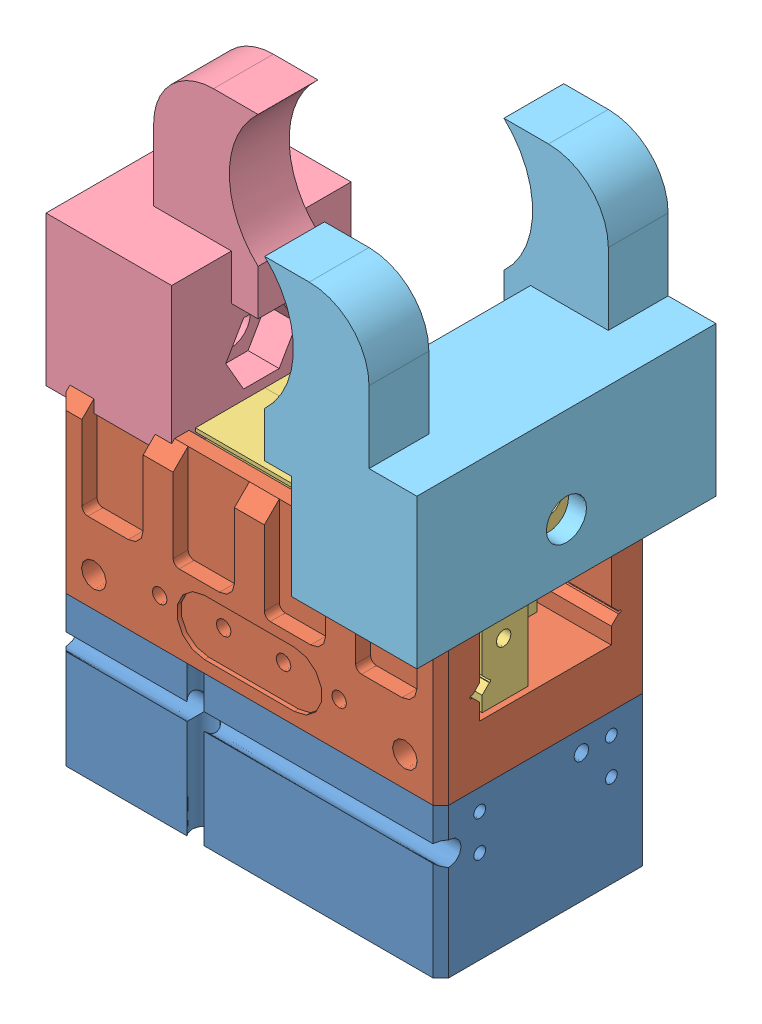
SolidWorks assembly scissor_draft0_assembly.SLDASM, configuration Default (file format 15000). Lengths in mm.
Overall size (72 98.4 50).
6 component instances, 5 part files, 15 mates.
Components (placement in the parent):
- SCHUNK-5518814 Gehaeuse MPG-plus 64-1: SCHUNK-5518814 Gehaeuse MPG-plus 64.sldprt [Default] at (0 25 0) x (1 0 0) z (0 0 -1) size (64.01 25 35.01)
- SCHUNK-5518813 Abdeckgehaeuse MPG-plus 64-1: SCHUNK-5518813 Abdeckgehaeuse MPG-plus 64.sldprt [Default] at (0 25 0) x (0 0 1) z (-1 0 0) size (35 29 64)
- SCHUNK-5518813 Finger MPG-plus 64-1: SCHUNK-5518813 Finger MPG-plus 64.sldprt [Default] at (-32 69.7 -0.75) x (-1 0 0) z (0 0 1) size (54 35.1 21.5)
- SCHUNK-5518813 Finger MPG-plus 64-2: SCHUNK-5518813 Finger MPG-plus 64.sldprt [Default] at (32 69.7 0.75) x (1 0 0) z (0 0 -1) size (54 35.1 21.5)
- gripper_1prong_draft2-1: gripper_1prong_draft2.SLDPRT [Default] at (-3 39.2255 0.5) x (1 0 0) z (0 0 -1) size (25.45 47 30)
- gripper_2prong_draft2-1: gripper_2prong_draft2.SLDPRT [Default] at (3 39.2255 0.5) x (-1 0 0) z (0 0 1) size (25.45 47 50)
Mates (geometry in assembly coordinates):
- Coincident2: coincident anti-aligned: plane of SCHUNK-5518814 Gehaeuse MPG-plus 64-1 through (-32 25 17.5) normal (0 1 0); plane of SCHUNK-5518813 Abdeckgehaeuse MPG-plus 64-1 through (32 25 -17.5) normal (0 -1 0)
- Coincident3: coincident aligned: plane of SCHUNK-5518814 Gehaeuse MPG-plus 64-1 through (-32 25 -16.2) normal (-1 0 0); plane of SCHUNK-5518813 Abdeckgehaeuse MPG-plus 64-1 through (-32 25 16.2) normal (-1 0 0)
- Coincident4: coincident aligned: plane of SCHUNK-5518814 Gehaeuse MPG-plus 64-1 through (30.7 25 -17.5) normal (0 0 -1); plane of SCHUNK-5518813 Abdeckgehaeuse MPG-plus 64-1 through (-30.7 25 -17.5) normal (0 0 -1)
- Distance4: distance = 1.4 mm anti-aligned: plane of SCHUNK-5518813 Abdeckgehaeuse MPG-plus 64-1 through (-32 40.17 -11) normal (0 0 1); plane of SCHUNK-5518813 Finger MPG-plus 64-1 through (21 47.13 -9.6) normal (0 0 -1)
- Distance5: distance = 3.9 mm anti-aligned: plane of SCHUNK-5518813 Finger MPG-plus 64-1 through (-31 51.4 -1.95) normal (0 0 1); plane of SCHUNK-5518813 Finger MPG-plus 64-2 through (31 51.4 1.95) normal (0 0 -1)
- Coincident10: coincident anti-aligned: plane of SCHUNK-5518813 Abdeckgehaeuse MPG-plus 64-1 through (32 34.6 -11) normal (0 1 0); plane of SCHUNK-5518813 Finger MPG-plus 64-1 through (21 34.6 -1.95) normal (0 -1 0)
- LimitDistance2: limit distance aligned: plane of SCHUNK-5518813 Finger MPG-plus 64-1 through (-32 69.7 -11.5) normal (-1 0 0); plane of SCHUNK-5518813 Abdeckgehaeuse MPG-plus 64-1 through (-32 25 16.2) normal (-1 0 0)
- LimitDistance3: limit distance aligned: plane of SCHUNK-5518813 Finger MPG-plus 64-2 through (32 69.7 11.5) normal (1 0 0); plane of SCHUNK-5518813 Abdeckgehaeuse MPG-plus 64-1 through (32 25 16.2) normal (1 0 0)
- Coincident15: coincident anti-aligned: plane of SCHUNK-5518813 Abdeckgehaeuse MPG-plus 64-1 through (32 34.6 -11) normal (0 1 0); plane of SCHUNK-5518813 Finger MPG-plus 64-2 through (-21 34.6 1.95) normal (0 -1 0)
- Coincident16: coincident anti-aligned: plane of SCHUNK-5518813 Finger MPG-plus 64-1 through (-22 69.7 -10) normal (0 1 0); plane of gripper_1prong_draft2-1 through (-3 69.7 0.5) normal (0 -1 0)
- Coincident17: coincident anti-aligned: plane of SCHUNK-5518813 Finger MPG-plus 64-1 through (-22 69.7 -10) normal (0 0 -1); plane of gripper_1prong_draft2-1 through (-33 69.7 -10) normal (0 0 1)
- Coincident18: coincident anti-aligned: plane of SCHUNK-5518813 Finger MPG-plus 64-1 through (-22 69.7 10) normal (1 0 0); plane of gripper_1prong_draft2-1 through (-22 69.7 11) normal (-1 0 0)
- Coincident19: coincident anti-aligned: plane of SCHUNK-5518813 Finger MPG-plus 64-2 through (22 69.7 10) normal (0 1 0); plane of gripper_2prong_draft2-1 through (3 69.7 0.5) normal (0 -1 0)
- Coincident20: coincident anti-aligned: plane of SCHUNK-5518813 Finger MPG-plus 64-2 through (22 69.7 -10) normal (-1 0 0); plane of gripper_2prong_draft2-1 through (22 69.7 -10) normal (1 0 0)
- Coincident21: coincident anti-aligned: plane of SCHUNK-5518813 Finger MPG-plus 64-2 through (22 69.7 -10) normal (0 0 -1); plane of gripper_2prong_draft2-1 through (33 69.7 -10) normal (0 0 1)
